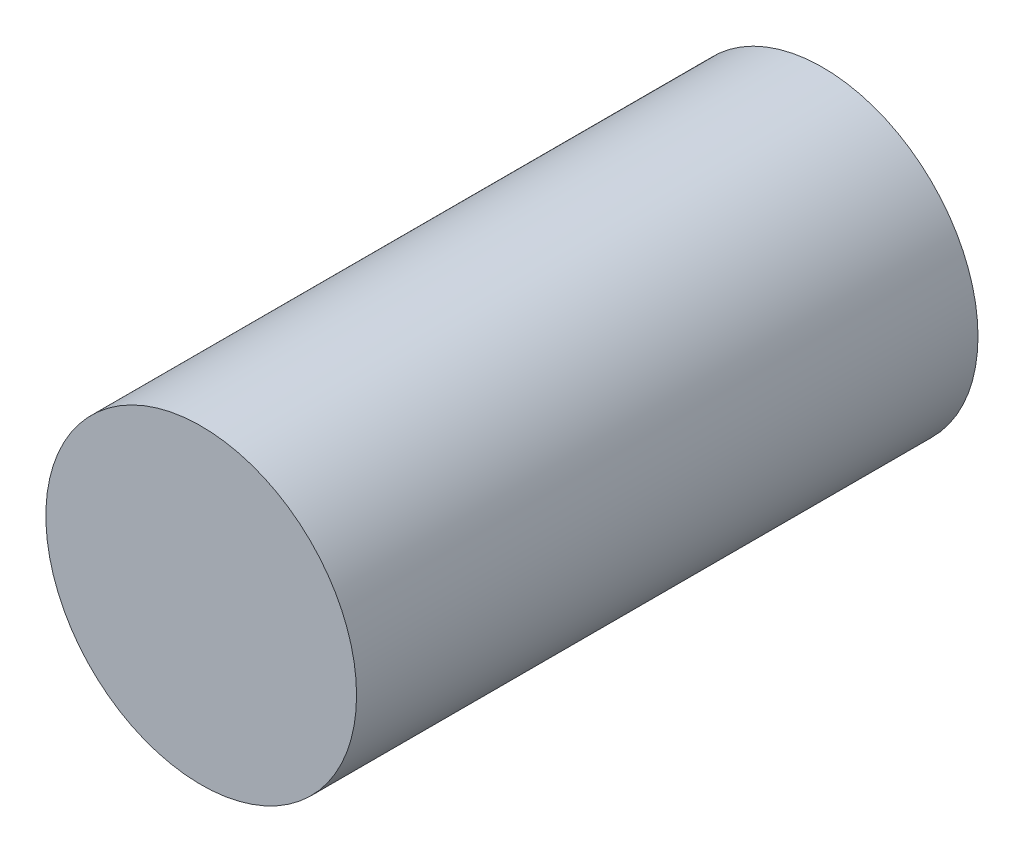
from build123d import *

# Parameters (mm, degrees)
SKETCH1_R           = 0.75
BOSS_EXTRUDE1_DEPTH = 3


with BuildPart() as part:
    # Sketch1 → Boss-Extrude1 (new body)
    with BuildSketch(Plane.XY):
        Circle(SKETCH1_R)
    extrude(amount=BOSS_EXTRUDE1_DEPTH)


solid = part.part
